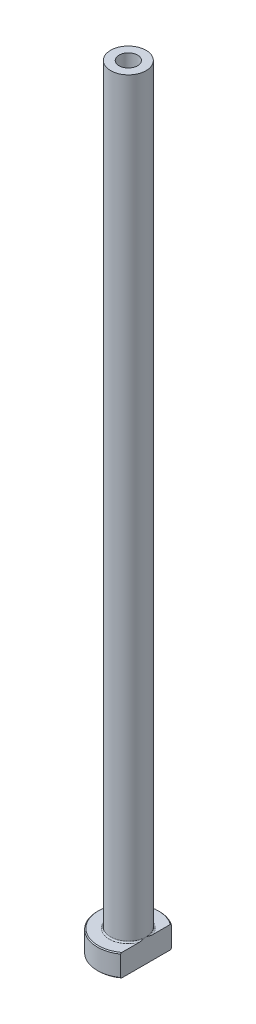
from build123d import *

# Parameters (mm, degrees)
FILLET1_R          = 0.3
CHAMFER1_SIZE      = 0.2
CUT_EXTRUDE1_DEPTH = 176.279776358
CHAMFER2_SIZE      = 0.5


with BuildPart() as part:
    # Sketch1 → Revolve1 (revolve)
    with BuildSketch(Plane.XY, mode=Mode.PRIVATE) as revolve1_sk:
        Polygon((-2.1, 175), (-4, 175), (-4, 5), (-7, 5), (-7, 0), (-2.35, 0), (-2.35, 118), (-2.1, 130), align=None)
    revolve(revolve1_sk.sketch.rotate(Axis((0, 92.187680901, 0), (0, -1, 0)), 270), axis=Axis((0, 92.187680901, 0), (0, -1, 0)))

    # Fillet1
    fillet1_edges = [part.edges().sort_by_distance(p)[0] for p in [
        (0, 5, -4),
    ]]
    fillet(fillet1_edges, radius=FILLET1_R)

    # Chamfer1
    chamfer1_edges = [part.edges().sort_by_distance(p)[0] for p in [
        (0, 0, -7),
        (0, 5, -7),
    ]]
    chamfer(chamfer1_edges, length=CHAMFER1_SIZE)

    # Sketch2 → Cut-Extrude1 (cut, through all)
    with BuildSketch(Plane.XZ):
        with BuildLine():
            Line((4, 5.744562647), (4, -5.744562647))
            ThreePointArc((4, -5.744562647), (7, 0), (4, 5.744562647))
        make_face()
    extrude(amount=-CUT_EXTRUDE1_DEPTH, mode=Mode.SUBTRACT)

    # Chamfer2
    chamfer2_edges = [part.edges().sort_by_distance(p)[0] for p in [
        (0, 0, -2.35),
    ]]
    chamfer(chamfer2_edges, length=CHAMFER2_SIZE)


solid = part.part
